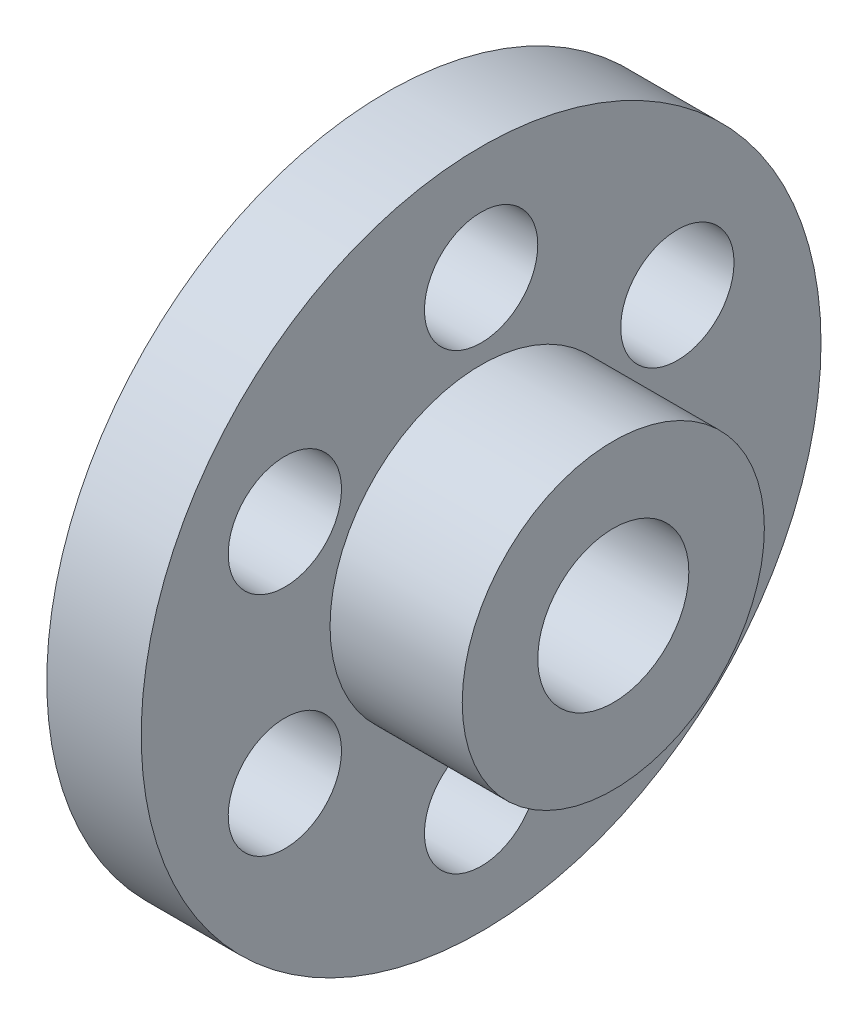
ISO-10303-21;
HEADER;
FILE_DESCRIPTION(('STEP AP214'),'2;1');
FILE_NAME('part.step','',(''),(''),'','','');
FILE_SCHEMA(('AUTOMOTIVE_DESIGN { 1 0 10303 214 1 1 1 1 }'));
ENDSEC;
DATA;
#1=APPLICATION_CONTEXT('core data for automotive mechanical design processes');
#2=APPLICATION_PROTOCOL_DEFINITION('international standard','automotive_design',2000,#1);
#3=PRODUCT_CONTEXT('',#1,'mechanical');
#4=PRODUCT('Part','Part','',(#3));
#5=PRODUCT_RELATED_PRODUCT_CATEGORY('part','',(#4));
#6=PRODUCT_DEFINITION_FORMATION('','',#4);
#7=PRODUCT_DEFINITION_CONTEXT('part definition',#1,'design');
#8=PRODUCT_DEFINITION('design','',#6,#7);
#9=PRODUCT_DEFINITION_SHAPE('','',#8);
#10=(LENGTH_UNIT() NAMED_UNIT(*) SI_UNIT(.MILLI.,.METRE.));
#11=(NAMED_UNIT(*) PLANE_ANGLE_UNIT() SI_UNIT($,.RADIAN.));
#12=(NAMED_UNIT(*) SI_UNIT($,.STERADIAN.) SOLID_ANGLE_UNIT());
#13=UNCERTAINTY_MEASURE_WITH_UNIT(LENGTH_MEASURE(1.E-05),#10,'distance_accuracy_value','');
#14=(GEOMETRIC_REPRESENTATION_CONTEXT(3) GLOBAL_UNCERTAINTY_ASSIGNED_CONTEXT((#13)) GLOBAL_UNIT_ASSIGNED_CONTEXT((#10,
#11,#12)) REPRESENTATION_CONTEXT('',''));
#15=CARTESIAN_POINT('',(0.,0.,0.));
#16=DIRECTION('',(0.,0.,1.));
#17=DIRECTION('',(1.,0.,0.));
#18=AXIS2_PLACEMENT_3D('',#15,#16,#17);
#19=CARTESIAN_POINT('',(0.,0.,0.));
#20=DIRECTION('',(-1.,0.,0.));
#21=DIRECTION('',(0.,0.,1.));
#22=AXIS2_PLACEMENT_3D('',#19,#20,#21);
#23=PLANE('',#22);
#24=CARTESIAN_POINT('',(0.,30.0000000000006,-51.961524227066));
#25=DIRECTION('',(-1.,0.,0.));
#26=DIRECTION('',(0.,0.866025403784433,0.50000000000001));
#27=AXIS2_PLACEMENT_3D('',#24,#25,#26);
#28=CIRCLE('',#27,15.);
#29=CARTESIAN_POINT('',(0.,42.9903810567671,-44.4615242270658));
#30=VERTEX_POINT('',#29);
#31=EDGE_CURVE('E106',#30,#30,#28,.T.);
#32=ORIENTED_EDGE('',*,*,#31,.F.);
#33=EDGE_LOOP('',(#32));
#34=FACE_BOUND('',#33,.T.);
#35=CARTESIAN_POINT('',(0.,-29.9999999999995,-51.9615242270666));
#36=DIRECTION('',(-1.,0.,0.));
#37=DIRECTION('',(0.,0.866025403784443,-0.499999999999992));
#38=AXIS2_PLACEMENT_3D('',#35,#36,#37);
#39=CIRCLE('',#38,15.);
#40=CARTESIAN_POINT('',(0.,-17.0096189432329,-59.4615242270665));
#41=VERTEX_POINT('',#40);
#42=EDGE_CURVE('E110',#41,#41,#39,.T.);
#43=ORIENTED_EDGE('',*,*,#42,.F.);
#44=EDGE_LOOP('',(#43));
#45=FACE_BOUND('',#44,.T.);
#46=CARTESIAN_POINT('',(0.,-60.,0.));
#47=DIRECTION('',(-1.,0.,0.));
#48=DIRECTION('',(0.,0.,-1.));
#49=AXIS2_PLACEMENT_3D('',#46,#47,#48);
#50=CIRCLE('',#49,15.);
#51=CARTESIAN_POINT('',(0.,-60.,-15.));
#52=VERTEX_POINT('',#51);
#53=EDGE_CURVE('E114',#52,#52,#50,.T.);
#54=ORIENTED_EDGE('',*,*,#53,.F.);
#55=EDGE_LOOP('',(#54));
#56=FACE_BOUND('',#55,.T.);
#57=CARTESIAN_POINT('',(0.,-30.0000000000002,51.9615242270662));
#58=DIRECTION('',(-1.,0.,0.));
#59=DIRECTION('',(0.,-0.866025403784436,-0.500000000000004));
#60=AXIS2_PLACEMENT_3D('',#57,#58,#59);
#61=CIRCLE('',#60,15.);
#62=CARTESIAN_POINT('',(0.,-42.9903810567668,44.4615242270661));
#63=VERTEX_POINT('',#62);
#64=EDGE_CURVE('E118',#63,#63,#61,.T.);
#65=ORIENTED_EDGE('',*,*,#64,.F.);
#66=EDGE_LOOP('',(#65));
#67=FACE_BOUND('',#66,.T.);
#68=CARTESIAN_POINT('',(0.,29.9999999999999,51.9615242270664));
#69=DIRECTION('',(-1.,0.,0.));
#70=DIRECTION('',(0.,-0.86602540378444,0.499999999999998));
#71=AXIS2_PLACEMENT_3D('',#68,#69,#70);
#72=CIRCLE('',#71,15.);
#73=CARTESIAN_POINT('',(0.,17.0096189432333,59.4615242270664));
#74=VERTEX_POINT('',#73);
#75=EDGE_CURVE('E55',#74,#74,#72,.T.);
#76=ORIENTED_EDGE('',*,*,#75,.F.);
#77=EDGE_LOOP('',(#76));
#78=FACE_BOUND('',#77,.T.);
#79=CARTESIAN_POINT('',(0.,60.,0.));
#80=DIRECTION('',(-1.,0.,0.));
#81=DIRECTION('',(0.,0.,1.));
#82=AXIS2_PLACEMENT_3D('',#79,#80,#81);
#83=CIRCLE('',#82,15.);
#84=CARTESIAN_POINT('',(0.,60.,15.));
#85=VERTEX_POINT('',#84);
#86=EDGE_CURVE('E50',#85,#85,#83,.T.);
#87=ORIENTED_EDGE('',*,*,#86,.F.);
#88=EDGE_LOOP('',(#87));
#89=FACE_BOUND('',#88,.T.);
#90=CARTESIAN_POINT('',(0.,0.,0.));
#91=DIRECTION('',(1.,0.,0.));
#92=DIRECTION('',(0.,0.,-1.));
#93=AXIS2_PLACEMENT_3D('',#90,#91,#92);
#94=CIRCLE('',#93,20.);
#95=CARTESIAN_POINT('',(0.,0.,-20.));
#96=VERTEX_POINT('',#95);
#97=EDGE_CURVE('E74',#96,#96,#94,.T.);
#98=ORIENTED_EDGE('',*,*,#97,.T.);
#99=EDGE_LOOP('',(#98));
#100=FACE_BOUND('',#99,.T.);
#101=CARTESIAN_POINT('',(0.,0.,0.));
#102=DIRECTION('',(1.,0.,0.));
#103=DIRECTION('',(0.,0.,-1.));
#104=AXIS2_PLACEMENT_3D('',#101,#102,#103);
#105=CIRCLE('',#104,90.);
#106=CARTESIAN_POINT('',(0.,0.,-90.));
#107=VERTEX_POINT('',#106);
#108=EDGE_CURVE('E10',#107,#107,#105,.T.);
#109=ORIENTED_EDGE('',*,*,#108,.F.);
#110=EDGE_LOOP('',(#109));
#111=FACE_BOUND('',#110,.T.);
#112=ADVANCED_FACE('F30',(#34,#45,#56,#67,#78,#89,#100,#111),#23,.T.);
#113=CARTESIAN_POINT('',(0.,0.,0.));
#114=DIRECTION('',(1.,0.,0.));
#115=DIRECTION('',(0.,0.,-1.));
#116=AXIS2_PLACEMENT_3D('',#113,#114,#115);
#117=CYLINDRICAL_SURFACE('',#116,90.);
#118=ORIENTED_EDGE('',*,*,#108,.T.);
#119=EDGE_LOOP('',(#118));
#120=FACE_BOUND('',#119,.T.);
#121=CARTESIAN_POINT('',(25.,0.,0.));
#122=DIRECTION('',(1.,0.,0.));
#123=DIRECTION('',(0.,0.,-1.));
#124=AXIS2_PLACEMENT_3D('',#121,#122,#123);
#125=CIRCLE('',#124,90.);
#126=CARTESIAN_POINT('',(25.,0.,-90.));
#127=VERTEX_POINT('',#126);
#128=EDGE_CURVE('E37',#127,#127,#125,.T.);
#129=ORIENTED_EDGE('',*,*,#128,.F.);
#130=EDGE_LOOP('',(#129));
#131=FACE_BOUND('',#130,.T.);
#132=ADVANCED_FACE('F89',(#120,#131),#117,.T.);
#133=CARTESIAN_POINT('',(25.,90.,0.));
#134=DIRECTION('',(1.,0.,0.));
#135=DIRECTION('',(0.,0.,-1.));
#136=AXIS2_PLACEMENT_3D('',#133,#134,#135);
#137=PLANE('',#136);
#138=CARTESIAN_POINT('',(25.,30.0000000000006,-51.961524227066));
#139=DIRECTION('',(1.,0.,0.));
#140=DIRECTION('',(0.,0.,-1.));
#141=AXIS2_PLACEMENT_3D('',#138,#139,#140);
#142=CIRCLE('',#141,15.);
#143=CARTESIAN_POINT('',(25.,30.0000000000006,-66.961524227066));
#144=VERTEX_POINT('',#143);
#145=EDGE_CURVE('E33',#144,#144,#142,.T.);
#146=ORIENTED_EDGE('',*,*,#145,.F.);
#147=EDGE_LOOP('',(#146));
#148=FACE_BOUND('',#147,.T.);
#149=CARTESIAN_POINT('',(25.,-29.9999999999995,-51.9615242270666));
#150=DIRECTION('',(1.,0.,0.));
#151=DIRECTION('',(0.,0.,-1.));
#152=AXIS2_PLACEMENT_3D('',#149,#150,#151);
#153=CIRCLE('',#152,15.);
#154=CARTESIAN_POINT('',(25.,-29.9999999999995,-66.9615242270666));
#155=VERTEX_POINT('',#154);
#156=EDGE_CURVE('E60',#155,#155,#153,.T.);
#157=ORIENTED_EDGE('',*,*,#156,.F.);
#158=EDGE_LOOP('',(#157));
#159=FACE_BOUND('',#158,.T.);
#160=CARTESIAN_POINT('',(25.,-60.,0.));
#161=DIRECTION('',(1.,0.,0.));
#162=DIRECTION('',(0.,0.,-1.));
#163=AXIS2_PLACEMENT_3D('',#160,#161,#162);
#164=CIRCLE('',#163,15.);
#165=CARTESIAN_POINT('',(25.,-60.,-15.));
#166=VERTEX_POINT('',#165);
#167=EDGE_CURVE('E58',#166,#166,#164,.T.);
#168=ORIENTED_EDGE('',*,*,#167,.F.);
#169=EDGE_LOOP('',(#168));
#170=FACE_BOUND('',#169,.T.);
#171=CARTESIAN_POINT('',(25.,-30.0000000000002,51.9615242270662));
#172=DIRECTION('',(1.,0.,0.));
#173=DIRECTION('',(0.,0.,-1.));
#174=AXIS2_PLACEMENT_3D('',#171,#172,#173);
#175=CIRCLE('',#174,15.);
#176=CARTESIAN_POINT('',(25.,-30.0000000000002,36.9615242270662));
#177=VERTEX_POINT('',#176);
#178=EDGE_CURVE('E54',#177,#177,#175,.T.);
#179=ORIENTED_EDGE('',*,*,#178,.F.);
#180=EDGE_LOOP('',(#179));
#181=FACE_BOUND('',#180,.T.);
#182=CARTESIAN_POINT('',(25.,29.9999999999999,51.9615242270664));
#183=DIRECTION('',(1.,0.,0.));
#184=DIRECTION('',(0.,0.,-1.));
#185=AXIS2_PLACEMENT_3D('',#182,#183,#184);
#186=CIRCLE('',#185,15.);
#187=CARTESIAN_POINT('',(25.,29.9999999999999,36.9615242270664));
#188=VERTEX_POINT('',#187);
#189=EDGE_CURVE('E51',#188,#188,#186,.T.);
#190=ORIENTED_EDGE('',*,*,#189,.F.);
#191=EDGE_LOOP('',(#190));
#192=FACE_BOUND('',#191,.T.);
#193=CARTESIAN_POINT('',(25.,60.,0.));
#194=DIRECTION('',(1.,0.,0.));
#195=DIRECTION('',(0.,0.,-1.));
#196=AXIS2_PLACEMENT_3D('',#193,#194,#195);
#197=CIRCLE('',#196,15.);
#198=CARTESIAN_POINT('',(25.,60.,-15.));
#199=VERTEX_POINT('',#198);
#200=EDGE_CURVE('E46',#199,#199,#197,.T.);
#201=ORIENTED_EDGE('',*,*,#200,.F.);
#202=EDGE_LOOP('',(#201));
#203=FACE_BOUND('',#202,.T.);
#204=ORIENTED_EDGE('',*,*,#128,.T.);
#205=EDGE_LOOP('',(#204));
#206=FACE_BOUND('',#205,.T.);
#207=CARTESIAN_POINT('',(25.,0.,0.));
#208=DIRECTION('',(1.,0.,0.));
#209=DIRECTION('',(0.,0.,-1.));
#210=AXIS2_PLACEMENT_3D('',#207,#208,#209);
#211=CIRCLE('',#210,40.);
#212=CARTESIAN_POINT('',(25.,0.,-40.));
#213=VERTEX_POINT('',#212);
#214=EDGE_CURVE('E42',#213,#213,#211,.T.);
#215=ORIENTED_EDGE('',*,*,#214,.F.);
#216=EDGE_LOOP('',(#215));
#217=FACE_BOUND('',#216,.T.);
#218=ADVANCED_FACE('F87',(#148,#159,#170,#181,#192,#203,#206,#217),#137,.T.);
#219=CARTESIAN_POINT('',(0.,0.,0.));
#220=DIRECTION('',(1.,0.,0.));
#221=DIRECTION('',(0.,0.,-1.));
#222=AXIS2_PLACEMENT_3D('',#219,#220,#221);
#223=CYLINDRICAL_SURFACE('',#222,40.);
#224=ORIENTED_EDGE('',*,*,#214,.T.);
#225=EDGE_LOOP('',(#224));
#226=FACE_BOUND('',#225,.T.);
#227=CARTESIAN_POINT('',(60.,0.,0.));
#228=DIRECTION('',(1.,0.,0.));
#229=DIRECTION('',(0.,0.,-1.));
#230=AXIS2_PLACEMENT_3D('',#227,#228,#229);
#231=CIRCLE('',#230,40.);
#232=CARTESIAN_POINT('',(60.,0.,-40.));
#233=VERTEX_POINT('',#232);
#234=EDGE_CURVE('E77',#233,#233,#231,.T.);
#235=ORIENTED_EDGE('',*,*,#234,.F.);
#236=EDGE_LOOP('',(#235));
#237=FACE_BOUND('',#236,.T.);
#238=ADVANCED_FACE('F84',(#226,#237),#223,.T.);
#239=CARTESIAN_POINT('',(60.,40.,0.));
#240=DIRECTION('',(1.,0.,0.));
#241=DIRECTION('',(0.,0.,-1.));
#242=AXIS2_PLACEMENT_3D('',#239,#240,#241);
#243=PLANE('',#242);
#244=CARTESIAN_POINT('',(60.,0.,0.));
#245=DIRECTION('',(1.,0.,0.));
#246=DIRECTION('',(0.,0.,-1.));
#247=AXIS2_PLACEMENT_3D('',#244,#245,#246);
#248=CIRCLE('',#247,20.);
#249=CARTESIAN_POINT('',(60.,0.,-20.));
#250=VERTEX_POINT('',#249);
#251=EDGE_CURVE('E49',#250,#250,#248,.T.);
#252=ORIENTED_EDGE('',*,*,#251,.F.);
#253=EDGE_LOOP('',(#252));
#254=FACE_BOUND('',#253,.T.);
#255=ORIENTED_EDGE('',*,*,#234,.T.);
#256=EDGE_LOOP('',(#255));
#257=FACE_BOUND('',#256,.T.);
#258=ADVANCED_FACE('F96',(#254,#257),#243,.T.);
#259=CARTESIAN_POINT('',(0.,0.,0.));
#260=DIRECTION('',(1.,0.,0.));
#261=DIRECTION('',(0.,0.,-1.));
#262=AXIS2_PLACEMENT_3D('',#259,#260,#261);
#263=CYLINDRICAL_SURFACE('',#262,20.);
#264=ORIENTED_EDGE('',*,*,#97,.F.);
#265=EDGE_LOOP('',(#264));
#266=FACE_BOUND('',#265,.T.);
#267=ORIENTED_EDGE('',*,*,#251,.T.);
#268=EDGE_LOOP('',(#267));
#269=FACE_BOUND('',#268,.T.);
#270=ADVANCED_FACE('F126',(#266,#269),#263,.F.);
#271=CARTESIAN_POINT('',(60.,60.,0.));
#272=DIRECTION('',(-1.,0.,0.));
#273=DIRECTION('',(0.,0.,1.));
#274=AXIS2_PLACEMENT_3D('',#271,#272,#273);
#275=CYLINDRICAL_SURFACE('',#274,15.);
#276=ORIENTED_EDGE('',*,*,#200,.T.);
#277=EDGE_LOOP('',(#276));
#278=FACE_BOUND('',#277,.T.);
#279=ORIENTED_EDGE('',*,*,#86,.T.);
#280=EDGE_LOOP('',(#279));
#281=FACE_BOUND('',#280,.T.);
#282=ADVANCED_FACE('F129',(#278,#281),#275,.F.);
#283=CARTESIAN_POINT('',(60.,29.9999999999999,51.9615242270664));
#284=DIRECTION('',(-1.,0.,0.));
#285=DIRECTION('',(0.,0.,1.));
#286=AXIS2_PLACEMENT_3D('',#283,#284,#285);
#287=CYLINDRICAL_SURFACE('',#286,15.);
#288=ORIENTED_EDGE('',*,*,#189,.T.);
#289=EDGE_LOOP('',(#288));
#290=FACE_BOUND('',#289,.T.);
#291=ORIENTED_EDGE('',*,*,#75,.T.);
#292=EDGE_LOOP('',(#291));
#293=FACE_BOUND('',#292,.T.);
#294=ADVANCED_FACE('F142',(#290,#293),#287,.F.);
#295=CARTESIAN_POINT('',(60.,-30.0000000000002,51.9615242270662));
#296=DIRECTION('',(-1.,0.,0.));
#297=DIRECTION('',(0.,0.,1.));
#298=AXIS2_PLACEMENT_3D('',#295,#296,#297);
#299=CYLINDRICAL_SURFACE('',#298,15.);
#300=ORIENTED_EDGE('',*,*,#178,.T.);
#301=EDGE_LOOP('',(#300));
#302=FACE_BOUND('',#301,.T.);
#303=ORIENTED_EDGE('',*,*,#64,.T.);
#304=EDGE_LOOP('',(#303));
#305=FACE_BOUND('',#304,.T.);
#306=ADVANCED_FACE('F146',(#302,#305),#299,.F.);
#307=CARTESIAN_POINT('',(60.,-60.,0.));
#308=DIRECTION('',(-1.,0.,0.));
#309=DIRECTION('',(0.,0.,1.));
#310=AXIS2_PLACEMENT_3D('',#307,#308,#309);
#311=CYLINDRICAL_SURFACE('',#310,15.);
#312=ORIENTED_EDGE('',*,*,#167,.T.);
#313=EDGE_LOOP('',(#312));
#314=FACE_BOUND('',#313,.T.);
#315=ORIENTED_EDGE('',*,*,#53,.T.);
#316=EDGE_LOOP('',(#315));
#317=FACE_BOUND('',#316,.T.);
#318=ADVANCED_FACE('F154',(#314,#317),#311,.F.);
#319=CARTESIAN_POINT('',(60.,-29.9999999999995,-51.9615242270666));
#320=DIRECTION('',(-1.,0.,0.));
#321=DIRECTION('',(0.,0.,1.));
#322=AXIS2_PLACEMENT_3D('',#319,#320,#321);
#323=CYLINDRICAL_SURFACE('',#322,15.);
#324=ORIENTED_EDGE('',*,*,#156,.T.);
#325=EDGE_LOOP('',(#324));
#326=FACE_BOUND('',#325,.T.);
#327=ORIENTED_EDGE('',*,*,#42,.T.);
#328=EDGE_LOOP('',(#327));
#329=FACE_BOUND('',#328,.T.);
#330=ADVANCED_FACE('F151',(#326,#329),#323,.F.);
#331=CARTESIAN_POINT('',(60.,30.0000000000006,-51.961524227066));
#332=DIRECTION('',(-1.,0.,0.));
#333=DIRECTION('',(0.,0.,1.));
#334=AXIS2_PLACEMENT_3D('',#331,#332,#333);
#335=CYLINDRICAL_SURFACE('',#334,15.);
#336=ORIENTED_EDGE('',*,*,#145,.T.);
#337=EDGE_LOOP('',(#336));
#338=FACE_BOUND('',#337,.T.);
#339=ORIENTED_EDGE('',*,*,#31,.T.);
#340=EDGE_LOOP('',(#339));
#341=FACE_BOUND('',#340,.T.);
#342=ADVANCED_FACE('F148',(#338,#341),#335,.F.);
#343=CLOSED_SHELL('',(#112,#132,#218,#238,#258,#270,#282,#294,#306,#318,#330,#342));
#344=MANIFOLD_SOLID_BREP('B2',#343);
#345=ADVANCED_BREP_SHAPE_REPRESENTATION('',(#18,#344),#14);
#346=SHAPE_DEFINITION_REPRESENTATION(#9,#345);
ENDSEC;
END-ISO-10303-21;
